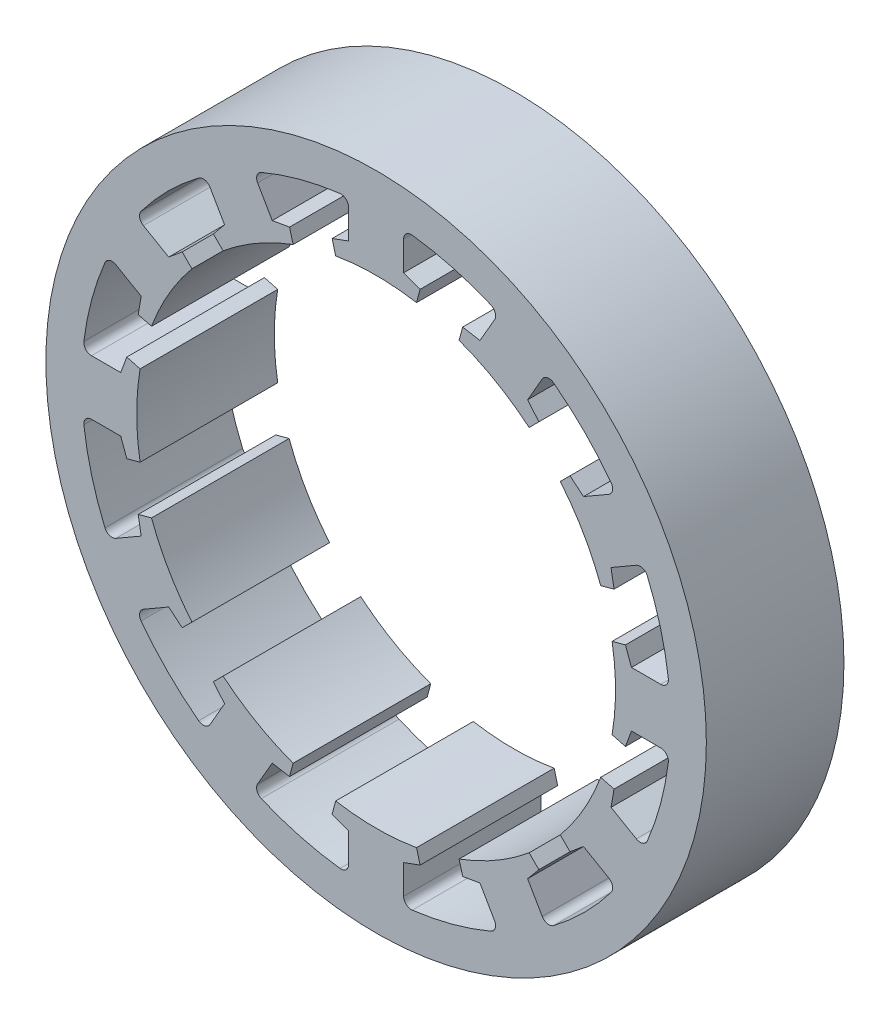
from build123d import *

# Parameters (mm, degrees)
SKETCH1_R                    = 60
BOSS_EXTRUDE1_DEPTH          = 25
SKETCH2_R                    = 43.5
CUT_EXTRUDE1_DEPTH           = 89.459030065
SLOTS_CUT_EXTRUDE_DEPTH      = 89.459030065
SLOTS_CUT_EXTRUDE_DEPTH_BACK = 89.459030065


with BuildPart() as part:
    # Sketch1 → Boss-Extrude1 (new body)
    with BuildSketch(Plane.XY):
        Circle(SKETCH1_R)
    extrude(amount=BOSS_EXTRUDE1_DEPTH)

    # Sketch2 → Cut-Extrude1 (cut, through all)
    with BuildSketch(Plane.XY.offset(25)):
        Circle(SKETCH2_R)
    extrude(amount=-CUT_EXTRUDE1_DEPTH, mode=Mode.SUBTRACT)

    # Sketch5 → Slots-Cut-Extrude (cut, two sides: drawn at the far end of the back side and taken through both)
    with BuildSketch(Plane.XY.offset(-SLOTS_CUT_EXTRUDE_DEPTH_BACK)):
        with BuildLine():
            Line((42.278203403, 30.182834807), (37.679608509, 27.527834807))
            Line((37.679608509, 27.527834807), (35.230210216, 29.571495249))
            Line((35.230210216, 29.571495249), (31.69467631, 26.035961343))
            Line((31.69467631, 26.035961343), (25.99265021, 31.651365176))
            Line((25.99265021, 31.651365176), (29.571495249, 35.230210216))
            Line((29.571495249, 35.230210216), (27.527834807, 37.679608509))
            Line((27.527834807, 37.679608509), (30.182834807, 42.278203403))
            ThreePointArc((30.182834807, 42.278203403), (31.116826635, 42.95023441), (32.238905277, 42.695467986))
            ThreePointArc((32.238905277, 42.695467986), (37.830212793, 37.830212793), (42.695467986, 32.238905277))
            ThreePointArc((42.695467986, 32.238905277), (42.95023441, 31.116826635), (42.278203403, 30.182834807))
        make_face()
        with BuildLine():
            Line((5, 51.705415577), (5, 46.395415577))
            Line((5, 46.395415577), (7.994561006, 45.296004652))
            Line((7.994561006, 45.296004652), (6.684612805, 40.407211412))
            Line((6.684612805, 40.407211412), (14.430414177, 38.39514209))
            Line((14.430414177, 38.39514209), (15.724509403, 43.224771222))
            Line((15.724509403, 43.224771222), (18.86758077, 42.679608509))
            Line((18.86758077, 42.679608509), (21.52258077, 47.278203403))
            ThreePointArc((21.52258077, 47.278203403), (21.63758078, 48.423079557), (20.855907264, 49.267444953))
            ThreePointArc((20.855907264, 49.267444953), (13.846818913, 51.677031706), (6.571976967, 53.094812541))
            ThreePointArc((6.571976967, 53.094812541), (5.472845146, 52.754407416), (5, 51.705415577))
        make_face()
        with BuildLine():
            Line((51.705415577, 5), (46.395415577, 5))
            Line((46.395415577, 5), (45.296004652, 7.994561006))
            Line((45.296004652, 7.994561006), (40.466375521, 6.70046578))
            Line((40.466375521, 6.70046578), (38.335977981, 14.414561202))
            Line((38.335977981, 14.414561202), (43.224771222, 15.724509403))
            Line((43.224771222, 15.724509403), (42.679608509, 18.86758077))
            Line((42.679608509, 18.86758077), (47.278203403, 21.52258077))
            ThreePointArc((47.278203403, 21.52258077), (48.423079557, 21.63758078), (49.267444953, 20.855907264))
            ThreePointArc((49.267444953, 20.855907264), (51.677031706, 13.846818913), (53.094812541, 6.571976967))
            ThreePointArc((53.094812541, 6.571976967), (52.754407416, 5.472845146), (51.705415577, 5))
        make_face()
        with BuildLine():
            Line((47.278203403, -21.52258077), (42.679608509, -18.86758077))
            Line((42.679608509, -18.86758077), (43.224771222, -15.724509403))
            Line((43.224771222, -15.724509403), (38.39514209, -14.430414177))
            Line((38.39514209, -14.430414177), (40.407211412, -6.684612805))
            Line((40.407211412, -6.684612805), (45.296004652, -7.994561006))
            Line((45.296004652, -7.994561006), (46.395415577, -5))
            Line((46.395415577, -5), (51.705415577, -5))
            ThreePointArc((51.705415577, -5), (52.754407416, -5.472845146), (53.094812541, -6.571976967))
            ThreePointArc((53.094812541, -6.571976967), (51.677031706, -13.846818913), (49.267444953, -20.855907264))
            ThreePointArc((49.267444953, -20.855907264), (48.423079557, -21.63758078), (47.278203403, -21.52258077))
        make_face()
        with BuildLine():
            Line((30.182834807, -42.278203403), (27.527834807, -37.679608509))
            Line((27.527834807, -37.679608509), (29.571495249, -35.230210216))
            Line((29.571495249, -35.230210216), (26.035961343, -31.69467631))
            Line((26.035961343, -31.69467631), (31.651365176, -25.99265021))
            Line((31.651365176, -25.99265021), (35.230210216, -29.571495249))
            Line((35.230210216, -29.571495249), (37.679608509, -27.527834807))
            Line((37.679608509, -27.527834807), (42.278203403, -30.182834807))
            ThreePointArc((42.278203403, -30.182834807), (42.95023441, -31.116826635), (42.695467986, -32.238905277))
            ThreePointArc((42.695467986, -32.238905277), (37.830212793, -37.830212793), (32.238905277, -42.695467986))
            ThreePointArc((32.238905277, -42.695467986), (31.116826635, -42.95023441), (30.182834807, -42.278203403))
        make_face()
        with BuildLine():
            Line((5, -51.705415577), (5, -46.395415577))
            Line((5, -46.395415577), (7.994561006, -45.296004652))
            Line((7.994561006, -45.296004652), (6.70046578, -40.466375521))
            Line((6.70046578, -40.466375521), (14.414561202, -38.335977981))
            Line((14.414561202, -38.335977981), (15.724509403, -43.224771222))
            Line((15.724509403, -43.224771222), (18.86758077, -42.679608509))
            Line((18.86758077, -42.679608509), (21.52258077, -47.278203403))
            ThreePointArc((21.52258077, -47.278203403), (21.63758078, -48.423079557), (20.855907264, -49.267444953))
            ThreePointArc((20.855907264, -49.267444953), (13.846818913, -51.677031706), (6.571976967, -53.094812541))
            ThreePointArc((6.571976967, -53.094812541), (5.472845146, -52.754407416), (5, -51.705415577))
        make_face()
        with BuildLine():
            Line((-21.52258077, -47.278203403), (-18.86758077, -42.679608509))
            Line((-18.86758077, -42.679608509), (-15.724509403, -43.224771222))
            Line((-15.724509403, -43.224771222), (-14.430414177, -38.39514209))
            Line((-14.430414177, -38.39514209), (-6.684612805, -40.407211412))
            Line((-6.684612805, -40.407211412), (-7.994561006, -45.296004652))
            Line((-7.994561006, -45.296004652), (-5, -46.395415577))
            Line((-5, -46.395415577), (-5, -51.705415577))
            ThreePointArc((-5, -51.705415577), (-5.472845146, -52.754407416), (-6.571976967, -53.094812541))
            ThreePointArc((-6.571976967, -53.094812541), (-13.846818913, -51.677031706), (-20.855907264, -49.267444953))
            ThreePointArc((-20.855907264, -49.267444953), (-21.63758078, -48.423079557), (-21.52258077, -47.278203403))
        make_face()
        with BuildLine():
            Line((-42.278203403, -30.182834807), (-37.679608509, -27.527834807))
            Line((-37.679608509, -27.527834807), (-35.230210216, -29.571495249))
            Line((-35.230210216, -29.571495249), (-31.69467631, -26.035961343))
            Line((-31.69467631, -26.035961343), (-25.99265021, -31.651365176))
            Line((-25.99265021, -31.651365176), (-29.571495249, -35.230210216))
            Line((-29.571495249, -35.230210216), (-27.527834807, -37.679608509))
            Line((-27.527834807, -37.679608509), (-30.182834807, -42.278203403))
            ThreePointArc((-30.182834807, -42.278203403), (-31.116826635, -42.95023441), (-32.238905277, -42.695467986))
            ThreePointArc((-32.238905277, -42.695467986), (-37.830212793, -37.830212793), (-42.695467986, -32.238905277))
            ThreePointArc((-42.695467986, -32.238905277), (-42.95023441, -31.116826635), (-42.278203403, -30.182834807))
        make_face()
        with BuildLine():
            Line((-51.705415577, -5), (-46.395415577, -5))
            Line((-46.395415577, -5), (-45.296004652, -7.994561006))
            Line((-45.296004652, -7.994561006), (-40.466375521, -6.70046578))
            Line((-40.466375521, -6.70046578), (-38.335977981, -14.414561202))
            Line((-38.335977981, -14.414561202), (-43.224771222, -15.724509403))
            Line((-43.224771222, -15.724509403), (-42.679608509, -18.86758077))
            Line((-42.679608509, -18.86758077), (-47.278203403, -21.52258077))
            ThreePointArc((-47.278203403, -21.52258077), (-48.423079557, -21.63758078), (-49.267444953, -20.855907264))
            ThreePointArc((-49.267444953, -20.855907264), (-51.677031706, -13.846818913), (-53.094812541, -6.571976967))
            ThreePointArc((-53.094812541, -6.571976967), (-52.754407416, -5.472845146), (-51.705415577, -5))
        make_face()
        with BuildLine():
            Line((-47.278203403, 21.52258077), (-42.679608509, 18.86758077))
            Line((-42.679608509, 18.86758077), (-43.224771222, 15.724509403))
            Line((-43.224771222, 15.724509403), (-38.39514209, 14.430414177))
            Line((-38.39514209, 14.430414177), (-40.407211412, 6.684612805))
            Line((-40.407211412, 6.684612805), (-45.296004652, 7.994561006))
            Line((-45.296004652, 7.994561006), (-46.395415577, 5))
            Line((-46.395415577, 5), (-51.705415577, 5))
            ThreePointArc((-51.705415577, 5), (-52.754407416, 5.472845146), (-53.094812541, 6.571976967))
            ThreePointArc((-53.094812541, 6.571976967), (-51.677031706, 13.846818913), (-49.267444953, 20.855907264))
            ThreePointArc((-49.267444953, 20.855907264), (-48.423079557, 21.63758078), (-47.278203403, 21.52258077))
        make_face()
        with BuildLine():
            Line((-30.182834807, 42.278203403), (-27.527834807, 37.679608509))
            Line((-27.527834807, 37.679608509), (-29.571495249, 35.230210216))
            Line((-29.571495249, 35.230210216), (-26.035961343, 31.69467631))
            Line((-26.035961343, 31.69467631), (-31.651365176, 25.99265021))
            Line((-31.651365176, 25.99265021), (-35.230210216, 29.571495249))
            Line((-35.230210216, 29.571495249), (-37.679608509, 27.527834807))
            Line((-37.679608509, 27.527834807), (-42.278203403, 30.182834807))
            ThreePointArc((-42.278203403, 30.182834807), (-42.95023441, 31.116826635), (-42.695467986, 32.238905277))
            ThreePointArc((-42.695467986, 32.238905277), (-37.830212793, 37.830212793), (-32.238905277, 42.695467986))
            ThreePointArc((-32.238905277, 42.695467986), (-31.116826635, 42.95023441), (-30.182834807, 42.278203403))
        make_face()
        with BuildLine():
            Line((-5, 51.705415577), (-5, 46.395415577))
            Line((-5, 46.395415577), (-7.994561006, 45.296004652))
            Line((-7.994561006, 45.296004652), (-6.70046578, 40.466375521))
            Line((-6.70046578, 40.466375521), (-14.414561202, 38.335977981))
            Line((-14.414561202, 38.335977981), (-15.724509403, 43.224771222))
            Line((-15.724509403, 43.224771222), (-18.86758077, 42.679608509))
            Line((-18.86758077, 42.679608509), (-21.52258077, 47.278203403))
            ThreePointArc((-21.52258077, 47.278203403), (-21.63758078, 48.423079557), (-20.855907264, 49.267444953))
            ThreePointArc((-20.855907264, 49.267444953), (-13.846818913, 51.677031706), (-6.571976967, 53.094812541))
            ThreePointArc((-6.571976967, 53.094812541), (-5.472845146, 52.754407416), (-5, 51.705415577))
        make_face()
    extrude(amount=SLOTS_CUT_EXTRUDE_DEPTH + SLOTS_CUT_EXTRUDE_DEPTH_BACK, mode=Mode.SUBTRACT)


solid = part.part
